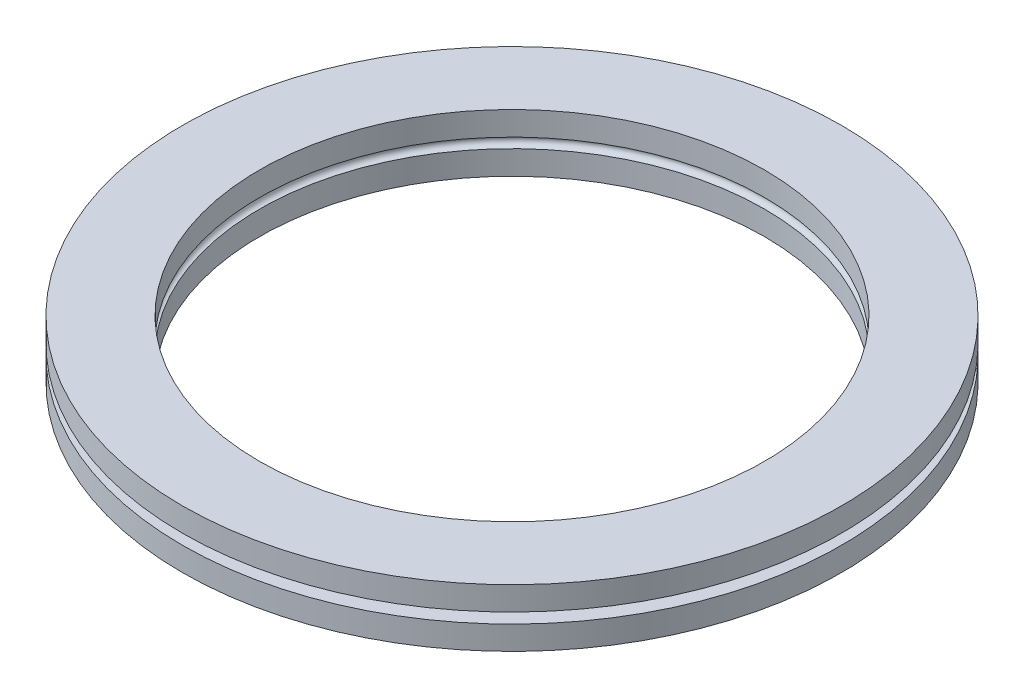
ISO-10303-21;
HEADER;
FILE_DESCRIPTION(('STEP AP214'),'2;1');
FILE_NAME('part.step','',(''),(''),'','','');
FILE_SCHEMA(('AUTOMOTIVE_DESIGN { 1 0 10303 214 1 1 1 1 }'));
ENDSEC;
DATA;
#1=APPLICATION_CONTEXT('core data for automotive mechanical design processes');
#2=APPLICATION_PROTOCOL_DEFINITION('international standard','automotive_design',2000,#1);
#3=PRODUCT_CONTEXT('',#1,'mechanical');
#4=PRODUCT('Part','Part','',(#3));
#5=PRODUCT_RELATED_PRODUCT_CATEGORY('part','',(#4));
#6=PRODUCT_DEFINITION_FORMATION('','',#4);
#7=PRODUCT_DEFINITION_CONTEXT('part definition',#1,'design');
#8=PRODUCT_DEFINITION('design','',#6,#7);
#9=PRODUCT_DEFINITION_SHAPE('','',#8);
#10=(LENGTH_UNIT() NAMED_UNIT(*) SI_UNIT(.MILLI.,.METRE.));
#11=(NAMED_UNIT(*) PLANE_ANGLE_UNIT() SI_UNIT($,.RADIAN.));
#12=(NAMED_UNIT(*) SI_UNIT($,.STERADIAN.) SOLID_ANGLE_UNIT());
#13=UNCERTAINTY_MEASURE_WITH_UNIT(LENGTH_MEASURE(1.E-05),#10,'distance_accuracy_value','');
#14=(GEOMETRIC_REPRESENTATION_CONTEXT(3) GLOBAL_UNCERTAINTY_ASSIGNED_CONTEXT((#13)) GLOBAL_UNIT_ASSIGNED_CONTEXT((#10,
#11,#12)) REPRESENTATION_CONTEXT('',''));
#15=CARTESIAN_POINT('',(0.,0.,0.));
#16=DIRECTION('',(0.,0.,1.));
#17=DIRECTION('',(1.,0.,0.));
#18=AXIS2_PLACEMENT_3D('',#15,#16,#17);
#19=CARTESIAN_POINT('',(0.,-8.7014749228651,0.));
#20=DIRECTION('',(0.,-1.,0.));
#21=DIRECTION('',(0.,0.,-1.));
#22=AXIS2_PLACEMENT_3D('',#19,#20,#21);
#23=CYLINDRICAL_SURFACE('',#22,108.585);
#24=CARTESIAN_POINT('',(0.,4.63550000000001,0.));
#25=DIRECTION('',(0.,-1.,0.));
#26=DIRECTION('',(0.,0.,-1.));
#27=AXIS2_PLACEMENT_3D('',#24,#25,#26);
#28=CIRCLE('',#27,108.585);
#29=CARTESIAN_POINT('',(0.,4.63550000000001,-108.585));
#30=VERTEX_POINT('',#29);
#31=EDGE_CURVE('E51',#30,#30,#28,.T.);
#32=ORIENTED_EDGE('',*,*,#31,.T.);
#33=EDGE_LOOP('',(#32));
#34=FACE_BOUND('',#33,.T.);
#35=CARTESIAN_POINT('',(0.,-3.17500000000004,0.));
#36=DIRECTION('',(0.,-1.,0.));
#37=DIRECTION('',(0.,0.,-1.));
#38=AXIS2_PLACEMENT_3D('',#35,#36,#37);
#39=CIRCLE('',#38,108.585);
#40=CARTESIAN_POINT('',(0.,-3.17500000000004,-108.585));
#41=VERTEX_POINT('',#40);
#42=EDGE_CURVE('E113',#41,#41,#39,.T.);
#43=ORIENTED_EDGE('',*,*,#42,.F.);
#44=EDGE_LOOP('',(#43));
#45=FACE_BOUND('',#44,.T.);
#46=ADVANCED_FACE('F28',(#34,#45),#23,.T.);
#47=CARTESIAN_POINT('',(108.585,4.63550000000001,0.));
#48=DIRECTION('',(0.,1.,0.));
#49=DIRECTION('',(0.,0.,1.));
#50=AXIS2_PLACEMENT_3D('',#47,#48,#49);
#51=PLANE('',#50);
#52=CARTESIAN_POINT('',(0.,4.63550000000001,0.));
#53=DIRECTION('',(0.,-1.,0.));
#54=DIRECTION('',(0.,0.,-1.));
#55=AXIS2_PLACEMENT_3D('',#52,#53,#54);
#56=CIRCLE('',#55,95.885);
#57=CARTESIAN_POINT('',(0.,4.63550000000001,-95.885));
#58=VERTEX_POINT('',#57);
#59=EDGE_CURVE('E86',#58,#58,#56,.T.);
#60=ORIENTED_EDGE('',*,*,#59,.T.);
#61=EDGE_LOOP('',(#60));
#62=FACE_BOUND('',#61,.T.);
#63=ORIENTED_EDGE('',*,*,#31,.F.);
#64=EDGE_LOOP('',(#63));
#65=FACE_BOUND('',#64,.T.);
#66=ADVANCED_FACE('F94',(#62,#65),#51,.T.);
#67=CARTESIAN_POINT('',(0.,-8.7014749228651,0.));
#68=DIRECTION('',(0.,-1.,0.));
#69=DIRECTION('',(0.,0.,-1.));
#70=AXIS2_PLACEMENT_3D('',#67,#68,#69);
#71=CYLINDRICAL_SURFACE('',#70,95.885);
#72=CARTESIAN_POINT('',(85.4075,6.34999999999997,-43.5831638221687));
#73=CARTESIAN_POINT('',(85.4074968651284,6.30424529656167,-43.5831700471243));
#74=CARTESIAN_POINT('',(85.4055753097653,6.2584340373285,-43.586936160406));
#75=CARTESIAN_POINT('',(85.3980933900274,6.16824643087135,-43.601593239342));
#76=CARTESIAN_POINT('',(85.392525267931,6.12387335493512,-43.6124993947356));
#77=CARTESIAN_POINT('',(85.3765644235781,6.02731621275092,-43.6437377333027));
#78=CARTESIAN_POINT('',(85.3653359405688,5.97580453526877,-43.66570120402));
#79=CARTESIAN_POINT('',(85.3392462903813,5.87743285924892,-43.716668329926));
#80=CARTESIAN_POINT('',(85.3243785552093,5.83058148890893,-43.7456847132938));
#81=CARTESIAN_POINT('',(85.2822356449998,5.71460964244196,-43.8278073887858));
#82=CARTESIAN_POINT('',(85.2528847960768,5.64909628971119,-43.8848893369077));
#83=CARTESIAN_POINT('',(85.1900202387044,5.52812318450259,-44.0067998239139));
#84=CARTESIAN_POINT('',(85.1564954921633,5.47269108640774,-44.0716488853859));
#85=CARTESIAN_POINT('',(85.0876820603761,5.37154043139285,-44.2043552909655));
#86=CARTESIAN_POINT('',(85.0524660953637,5.32559879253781,-44.272082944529));
#87=CARTESIAN_POINT('',(84.980192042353,5.24026745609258,-44.4106553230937));
#88=CARTESIAN_POINT('',(84.9431322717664,5.2008838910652,-44.4815028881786));
#89=CARTESIAN_POINT('',(84.867596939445,5.12769365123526,-44.6254505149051));
#90=CARTESIAN_POINT('',(84.8291190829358,5.09389654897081,-44.6985541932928));
#91=CARTESIAN_POINT('',(84.7510970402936,5.03125947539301,-44.8463127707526));
#92=CARTESIAN_POINT('',(84.7115524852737,5.0024212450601,-44.9209682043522));
#93=CARTESIAN_POINT('',(84.5950171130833,4.92480574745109,-45.1402577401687));
#94=CARTESIAN_POINT('',(84.5168837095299,4.88194062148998,-45.2863940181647));
#95=CARTESIAN_POINT('',(84.3583979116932,4.81017095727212,-45.5809387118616));
#96=CARTESIAN_POINT('',(84.2780436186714,4.78127878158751,-45.7293490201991));
#97=CARTESIAN_POINT('',(84.1155692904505,4.7363125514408,-46.0275255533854));
#98=CARTESIAN_POINT('',(84.0334460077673,4.72026458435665,-46.1772939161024));
#99=CARTESIAN_POINT('',(83.8680894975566,4.70067393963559,-46.4769411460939));
#100=CARTESIAN_POINT('',(83.7848568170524,4.69712531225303,-46.6268199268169));
#101=CARTESIAN_POINT('',(83.6291953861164,4.70233732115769,-46.9053594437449));
#102=CARTESIAN_POINT('',(83.556856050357,4.70947127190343,-47.0341018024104));
#103=CARTESIAN_POINT('',(83.4119523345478,4.73368063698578,-47.2906029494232));
#104=CARTESIAN_POINT('',(83.3393878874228,4.75075936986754,-47.4183613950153));
#105=CARTESIAN_POINT('',(83.1948381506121,4.79563861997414,-47.6715142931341));
#106=CARTESIAN_POINT('',(83.1228517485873,4.82338768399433,-47.7969171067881));
#107=CARTESIAN_POINT('',(82.9797782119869,4.89096994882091,-48.0448755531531));
#108=CARTESIAN_POINT('',(82.9086902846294,4.93079158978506,-48.1674337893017));
#109=CARTESIAN_POINT('',(82.7863121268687,5.01266010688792,-48.3773761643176));
#110=CARTESIAN_POINT('',(82.7346044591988,5.05153854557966,-48.4657462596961));
#111=CARTESIAN_POINT('',(82.6328115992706,5.13854640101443,-48.6390971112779));
#112=CARTESIAN_POINT('',(82.582728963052,5.18668963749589,-48.724072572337));
#113=CARTESIAN_POINT('',(82.4849486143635,5.29439104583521,-48.8894240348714));
#114=CARTESIAN_POINT('',(82.4372764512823,5.35404814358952,-48.9697517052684));
#115=CARTESIAN_POINT('',(82.3468597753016,5.48678360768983,-49.1216411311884));
#116=CARTESIAN_POINT('',(82.3040995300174,5.55981706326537,-49.1932309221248));
#117=CARTESIAN_POINT('',(82.2444057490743,5.68532312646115,-49.2929273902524));
#118=CARTESIAN_POINT('',(82.2244955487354,5.73230744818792,-49.3261270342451));
#119=CARTESIAN_POINT('',(82.1882096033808,5.83130535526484,-49.386563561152));
#120=CARTESIAN_POINT('',(82.171833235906,5.88331805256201,-49.4138014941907));
#121=CARTESIAN_POINT('',(82.1436146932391,5.99274925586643,-49.460697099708));
#122=CARTESIAN_POINT('',(82.1318335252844,6.05022866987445,-49.4802528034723));
#123=CARTESIAN_POINT('',(82.1144163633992,6.16857717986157,-49.5091521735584));
#124=CARTESIAN_POINT('',(82.108767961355,6.22943916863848,-49.5185164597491));
#125=CARTESIAN_POINT('',(82.1046662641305,6.34351649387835,-49.5253168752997));
#126=CARTESIAN_POINT('',(82.1053194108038,6.39661454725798,-49.5242343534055));
#127=CARTESIAN_POINT('',(82.1116402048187,6.50168266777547,-49.5137536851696));
#128=CARTESIAN_POINT('',(82.1173098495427,6.55365227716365,-49.5043522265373));
#129=CARTESIAN_POINT('',(82.1324985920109,6.65112326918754,-49.4791480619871));
#130=CARTESIAN_POINT('',(82.141697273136,6.69681749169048,-49.4638780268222));
#131=CARTESIAN_POINT('',(82.163255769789,6.78525585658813,-49.4280594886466));
#132=CARTESIAN_POINT('',(82.1756161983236,6.82799942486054,-49.4075099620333));
#133=CARTESIAN_POINT('',(82.2119543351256,6.93770802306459,-49.3470334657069));
#134=CARTESIAN_POINT('',(82.238184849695,7.00183350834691,-49.3033188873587));
#135=CARTESIAN_POINT('',(82.2953309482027,7.12149991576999,-49.2078737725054));
#136=CARTESIAN_POINT('',(82.3262615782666,7.17701206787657,-49.1561174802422));
#137=CARTESIAN_POINT('',(82.3864983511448,7.27282791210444,-49.0550819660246));
#138=CARTESIAN_POINT('',(82.4153938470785,7.31417017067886,-49.0065247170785));
#139=CARTESIAN_POINT('',(82.4748116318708,7.39185896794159,-48.9064623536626));
#140=CARTESIAN_POINT('',(82.5053351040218,7.42820180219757,-48.8549550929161));
#141=CARTESIAN_POINT('',(82.567574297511,7.49646938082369,-48.7496937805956));
#142=CARTESIAN_POINT('',(82.5992914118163,7.52838874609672,-48.6959370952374));
#143=CARTESIAN_POINT('',(82.6635771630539,7.58824373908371,-48.5867292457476));
#144=CARTESIAN_POINT('',(82.6961461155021,7.61617786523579,-48.5312774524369));
#145=CARTESIAN_POINT('',(82.7906781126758,7.69134636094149,-48.3699460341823));
#146=CARTESIAN_POINT('',(82.8534176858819,7.73407312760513,-48.2624103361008));
#147=CARTESIAN_POINT('',(82.9800616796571,7.80888561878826,-48.0443392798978));
#148=CARTESIAN_POINT('',(83.0439670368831,7.84096234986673,-47.9338014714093));
#149=CARTESIAN_POINT('',(83.1724582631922,7.89582840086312,-47.7105023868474));
#150=CARTESIAN_POINT('',(83.2370453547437,7.91859630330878,-47.5977366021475));
#151=CARTESIAN_POINT('',(83.3663547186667,7.95564879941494,-47.3708897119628));
#152=CARTESIAN_POINT('',(83.4310770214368,7.96993121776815,-47.256808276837));
#153=CARTESIAN_POINT('',(83.5897885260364,7.99532593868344,-46.975706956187));
#154=CARTESIAN_POINT('',(83.6836893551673,8.0020359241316,-46.8082275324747));
#155=CARTESIAN_POINT('',(83.8704828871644,7.99970737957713,-46.4727044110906));
#156=CARTESIAN_POINT('',(83.9633747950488,7.99065722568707,-46.3046603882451));
#157=CARTESIAN_POINT('',(84.1474399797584,7.95677583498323,-45.9693167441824));
#158=CARTESIAN_POINT('',(84.2386144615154,7.9319561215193,-45.8020166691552));
#159=CARTESIAN_POINT('',(84.373522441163,7.8821128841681,-45.5527263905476));
#160=CARTESIAN_POINT('',(84.4181681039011,7.86340460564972,-45.4699338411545));
#161=CARTESIAN_POINT('',(84.5067406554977,7.82151041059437,-45.3051073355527));
#162=CARTESIAN_POINT('',(84.5506676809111,7.79832535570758,-45.223073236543));
#163=CARTESIAN_POINT('',(84.6359509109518,7.7481125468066,-45.0632546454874));
#164=CARTESIAN_POINT('',(84.6773403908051,7.72127105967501,-44.9854296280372));
#165=CARTESIAN_POINT('',(84.7591254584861,7.66265947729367,-44.8311442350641));
#166=CARTESIAN_POINT('',(84.7995213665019,7.63089099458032,-44.7546834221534));
#167=CARTESIAN_POINT('',(84.8789062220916,7.56192415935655,-44.6039429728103));
#168=CARTESIAN_POINT('',(84.9179002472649,7.52474854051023,-44.5296556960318));
#169=CARTESIAN_POINT('',(84.9942368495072,7.44402760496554,-44.3837773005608));
#170=CARTESIAN_POINT('',(85.0315807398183,7.40048747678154,-44.3121840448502));
#171=CARTESIAN_POINT('',(85.0972917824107,7.31459011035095,-44.1858376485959));
#172=CARTESIAN_POINT('',(85.1260400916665,7.27350864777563,-44.1304222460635));
#173=CARTESIAN_POINT('',(85.1815297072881,7.18534997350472,-44.0232195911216));
#174=CARTESIAN_POINT('',(85.2082674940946,7.13826261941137,-43.9714387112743));
#175=CARTESIAN_POINT('',(85.2590692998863,7.03655896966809,-43.8728552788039));
#176=CARTESIAN_POINT('',(85.2830999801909,6.98186418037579,-43.8261150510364));
#177=CARTESIAN_POINT('',(85.3265651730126,6.86437712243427,-43.7414306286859));
#178=CARTESIAN_POINT('',(85.3460148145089,6.80161259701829,-43.7034574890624));
#179=CARTESIAN_POINT('',(85.3719172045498,6.69355939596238,-43.6528287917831));
#180=CARTESIAN_POINT('',(85.3804980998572,6.65072903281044,-43.6360401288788));
#181=CARTESIAN_POINT('',(85.3943567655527,6.56260022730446,-43.6089129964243));
#182=CARTESIAN_POINT('',(85.3996437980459,6.51730909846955,-43.5985564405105));
#183=CARTESIAN_POINT('',(85.4045115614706,6.45132525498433,-43.5890197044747));
#184=CARTESIAN_POINT('',(85.4056290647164,6.43114484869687,-43.5868300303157));
#185=CARTESIAN_POINT('',(85.4071240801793,6.39064670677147,-43.5839005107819));
#186=CARTESIAN_POINT('',(85.4075013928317,6.37032893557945,-43.5831610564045));
#187=CARTESIAN_POINT('',(85.4075,6.34999999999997,-43.5831638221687));
#188=B_SPLINE_CURVE_WITH_KNOTS('',3,(#72,#73,#74,#75,#76,#77,#78,#79,#80,#81,#82,#83,#84,#85,
#86,#87,#88,#89,#90,#91,#92,#93,#94,#95,#96,#97,#98,#99,#100,#101,#102,#103,#104,#105,#106,#107,
#108,#109,#110,#111,#112,#113,#114,#115,#116,#117,#118,#119,#120,#121,#122,#123,#124,#125,#126,
#127,#128,#129,#130,#131,#132,#133,#134,#135,#136,#137,#138,#139,#140,#141,#142,#143,#144,#145,
#146,#147,#148,#149,#150,#151,#152,#153,#154,#155,#156,#157,#158,#159,#160,#161,#162,#163,#164,
#165,#166,#167,#168,#169,#170,#171,#172,#173,#174,#175,#176,#177,#178,#179,#180,#181,#182,#183,
#184,#185,#186,#187),.UNSPECIFIED.,.T.,.F.,(4,2,2,2,2,2,2,2,2,2,2,2,2,2,2,2,2,2,2,2,2,2,2,2,2,2,
2,2,2,2,2,2,2,2,2,2,2,2,2,2,2,2,2,2,2,2,2,2,2,2,2,2,2,2,2,2,2,4),(0.,0.137178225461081,
0.274649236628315,0.445022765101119,0.615706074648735,0.889310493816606,1.16365448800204,
1.43054105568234,1.69767580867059,1.965263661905,2.23294526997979,2.74565556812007,
3.2588186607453,3.77302139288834,4.28697932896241,4.73021122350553,5.17359110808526,
5.61485926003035,6.05570621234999,6.38391045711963,6.71260811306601,7.04426688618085,
7.37483188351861,7.55699897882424,7.73913396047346,7.92361080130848,8.10771369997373,
8.2661421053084,8.42463361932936,8.57124447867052,8.71788378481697,8.96223806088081,
9.20739172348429,9.4171359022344,9.62703466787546,9.83718647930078,10.0474172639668,
10.4416585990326,10.8362320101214,11.2317082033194,11.627285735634,12.2029268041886,
12.7789926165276,13.3546379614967,13.6422671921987,13.929841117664,14.2061418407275,
14.4823523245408,14.7574333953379,15.0322914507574,15.2562189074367,15.4805296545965,
15.7073553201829,15.9334210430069,16.0733136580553,16.2128111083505,16.2737433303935,
16.3346919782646),.UNSPECIFIED.);
#189=CARTESIAN_POINT('',(85.4075,6.34999999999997,-43.5831638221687));
#190=VERTEX_POINT('',#189);
#191=EDGE_CURVE('E54',#190,#190,#188,.T.);
#192=ORIENTED_EDGE('',*,*,#191,.F.);
#193=EDGE_LOOP('',(#192));
#194=FACE_BOUND('',#193,.T.);
#195=CARTESIAN_POINT('',(0.,8.06450000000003,0.));
#196=DIRECTION('',(0.,-1.,0.));
#197=DIRECTION('',(0.,0.,-1.));
#198=AXIS2_PLACEMENT_3D('',#195,#196,#197);
#199=CIRCLE('',#198,95.885);
#200=CARTESIAN_POINT('',(0.,8.06450000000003,-95.885));
#201=VERTEX_POINT('',#200);
#202=EDGE_CURVE('E83',#201,#201,#199,.T.);
#203=ORIENTED_EDGE('',*,*,#202,.T.);
#204=EDGE_LOOP('',(#203));
#205=FACE_BOUND('',#204,.T.);
#206=ORIENTED_EDGE('',*,*,#59,.F.);
#207=EDGE_LOOP('',(#206));
#208=FACE_BOUND('',#207,.T.);
#209=ADVANCED_FACE('F96',(#194,#205,#208),#71,.T.);
#210=CARTESIAN_POINT('',(95.885,8.06450000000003,0.));
#211=DIRECTION('',(0.,-1.,0.));
#212=DIRECTION('',(0.,0.,-1.));
#213=AXIS2_PLACEMENT_3D('',#210,#211,#212);
#214=PLANE('',#213);
#215=CARTESIAN_POINT('',(0.,8.06450000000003,0.));
#216=DIRECTION('',(0.,-1.,0.));
#217=DIRECTION('',(0.,0.,-1.));
#218=AXIS2_PLACEMENT_3D('',#215,#216,#217);
#219=CIRCLE('',#218,108.585);
#220=CARTESIAN_POINT('',(0.,8.06450000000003,-108.585));
#221=VERTEX_POINT('',#220);
#222=EDGE_CURVE('E80',#221,#221,#219,.T.);
#223=ORIENTED_EDGE('',*,*,#222,.T.);
#224=EDGE_LOOP('',(#223));
#225=FACE_BOUND('',#224,.T.);
#226=ORIENTED_EDGE('',*,*,#202,.F.);
#227=EDGE_LOOP('',(#226));
#228=FACE_BOUND('',#227,.T.);
#229=ADVANCED_FACE('F102',(#225,#228),#214,.T.);
#230=CARTESIAN_POINT('',(0.,-8.7014749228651,0.));
#231=DIRECTION('',(0.,-1.,0.));
#232=DIRECTION('',(0.,0.,-1.));
#233=AXIS2_PLACEMENT_3D('',#230,#231,#232);
#234=CYLINDRICAL_SURFACE('',#233,108.585);
#235=CARTESIAN_POINT('',(0.,15.875,0.));
#236=DIRECTION('',(0.,-1.,0.));
#237=DIRECTION('',(0.,0.,-1.));
#238=AXIS2_PLACEMENT_3D('',#235,#236,#237);
#239=CIRCLE('',#238,108.585);
#240=CARTESIAN_POINT('',(0.,15.875,-108.585));
#241=VERTEX_POINT('',#240);
#242=EDGE_CURVE('E72',#241,#241,#239,.T.);
#243=ORIENTED_EDGE('',*,*,#242,.T.);
#244=EDGE_LOOP('',(#243));
#245=FACE_BOUND('',#244,.T.);
#246=ORIENTED_EDGE('',*,*,#222,.F.);
#247=EDGE_LOOP('',(#246));
#248=FACE_BOUND('',#247,.T.);
#249=ADVANCED_FACE('F132',(#245,#248),#234,.T.);
#250=CARTESIAN_POINT('',(83.185,15.875,0.));
#251=DIRECTION('',(0.,1.,0.));
#252=DIRECTION('',(0.,0.,1.));
#253=AXIS2_PLACEMENT_3D('',#250,#251,#252);
#254=PLANE('',#253);
#255=CARTESIAN_POINT('',(0.,15.875,0.));
#256=DIRECTION('',(0.,-1.,0.));
#257=DIRECTION('',(0.,0.,-1.));
#258=AXIS2_PLACEMENT_3D('',#255,#256,#257);
#259=CIRCLE('',#258,83.185);
#260=CARTESIAN_POINT('',(0.,15.875,-83.185));
#261=VERTEX_POINT('',#260);
#262=EDGE_CURVE('E69',#261,#261,#259,.T.);
#263=ORIENTED_EDGE('',*,*,#262,.T.);
#264=EDGE_LOOP('',(#263));
#265=FACE_BOUND('',#264,.T.);
#266=ORIENTED_EDGE('',*,*,#242,.F.);
#267=EDGE_LOOP('',(#266));
#268=FACE_BOUND('',#267,.T.);
#269=ADVANCED_FACE('F130',(#265,#268),#254,.T.);
#270=CARTESIAN_POINT('',(0.,-8.7014749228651,0.));
#271=DIRECTION('',(0.,-1.,0.));
#272=DIRECTION('',(0.,0.,-1.));
#273=AXIS2_PLACEMENT_3D('',#270,#271,#272);
#274=CYLINDRICAL_SURFACE('',#273,83.185);
#275=CARTESIAN_POINT('',(0.,8.00100000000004,0.));
#276=DIRECTION('',(0.,-1.,0.));
#277=DIRECTION('',(0.,0.,-1.));
#278=AXIS2_PLACEMENT_3D('',#275,#276,#277);
#279=CIRCLE('',#278,83.185);
#280=CARTESIAN_POINT('',(0.,8.00100000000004,-83.185));
#281=VERTEX_POINT('',#280);
#282=EDGE_CURVE('E67',#281,#281,#279,.T.);
#283=ORIENTED_EDGE('',*,*,#282,.T.);
#284=EDGE_LOOP('',(#283));
#285=FACE_BOUND('',#284,.T.);
#286=ORIENTED_EDGE('',*,*,#262,.F.);
#287=EDGE_LOOP('',(#286));
#288=FACE_BOUND('',#287,.T.);
#289=ADVANCED_FACE('F60',(#285,#288),#274,.F.);
#290=CARTESIAN_POINT('',(0.,6.34999999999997,0.));
#291=DIRECTION('',(0.,-1.,0.));
#292=DIRECTION('',(0.,0.,-1.));
#293=AXIS2_PLACEMENT_3D('',#290,#291,#292);
#294=TOROIDAL_SURFACE('',#293,83.185,1.65100000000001);
#295=CARTESIAN_POINT('',(83.4707499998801,7.97608361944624,0.0002));
#296=CARTESIAN_POINT('',(83.4707510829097,7.97605274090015,-0.550187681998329));
#297=CARTESIAN_POINT('',(83.4680294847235,7.97560418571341,-1.10057705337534));
#298=CARTESIAN_POINT('',(83.457144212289,7.97365176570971,-2.20126344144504));
#299=CARTESIAN_POINT('',(83.4489808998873,7.97214797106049,-2.75156046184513));
#300=CARTESIAN_POINT('',(83.4314076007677,7.9686900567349,-3.6400824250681));
#301=CARTESIAN_POINT('',(83.4236891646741,7.9671325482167,-3.97834309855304));
#302=CARTESIAN_POINT('',(83.4061975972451,7.96343401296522,-4.65482119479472));
#303=CARTESIAN_POINT('',(83.3964243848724,7.96129296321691,-4.99303861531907));
#304=CARTESIAN_POINT('',(83.3640150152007,7.95382574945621,-6.00790123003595));
#305=CARTESIAN_POINT('',(83.3382953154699,7.94745653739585,-6.68444385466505));
#306=CARTESIAN_POINT('',(83.2786525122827,7.93063951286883,-8.03713574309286));
#307=CARTESIAN_POINT('',(83.2447291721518,7.92019158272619,-8.71328499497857));
#308=CARTESIAN_POINT('',(83.1687019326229,7.89335177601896,-10.0650656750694));
#309=CARTESIAN_POINT('',(83.126597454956,7.87695947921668,-10.7406970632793));
#310=CARTESIAN_POINT('',(83.0573386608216,7.84586261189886,-11.7535102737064));
#311=CARTESIAN_POINT('',(83.0332358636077,7.8344125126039,-12.0910030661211));
#312=CARTESIAN_POINT('',(82.9830036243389,7.80887000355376,-12.7657366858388));
#313=CARTESIAN_POINT('',(82.9568742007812,7.79477761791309,-13.102977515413));
#314=CARTESIAN_POINT('',(82.9025947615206,7.76337547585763,-13.7771924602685));
#315=CARTESIAN_POINT('',(82.874444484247,7.74606530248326,-14.1141665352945));
#316=CARTESIAN_POINT('',(82.8161390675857,7.70747828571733,-14.787727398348));
#317=CARTESIAN_POINT('',(82.7859838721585,7.68620133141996,-15.1243141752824));
#318=CARTESIAN_POINT('',(82.7236961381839,7.63866304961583,-15.7968874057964));
#319=CARTESIAN_POINT('',(82.6915639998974,7.61240272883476,-16.1328739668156));
#320=CARTESIAN_POINT('',(82.6253502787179,7.5534463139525,-16.8040826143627));
#321=CARTESIAN_POINT('',(82.5912688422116,7.52075070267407,-17.1393047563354));
#322=CARTESIAN_POINT('',(82.5387233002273,7.46510690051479,-17.6413121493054));
#323=CARTESIAN_POINT('',(82.5209679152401,7.4454552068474,-17.8085371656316));
#324=CARTESIAN_POINT('',(82.4849958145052,7.40349177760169,-18.1426145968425));
#325=CARTESIAN_POINT('',(82.4667790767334,7.3811799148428,-18.3094669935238));
#326=CARTESIAN_POINT('',(82.4298982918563,7.33328276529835,-18.642705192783));
#327=CARTESIAN_POINT('',(82.4112341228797,7.30769657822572,-18.8090908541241));
#328=CARTESIAN_POINT('',(82.3734966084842,7.25234395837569,-19.1411026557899));
#329=CARTESIAN_POINT('',(82.35442331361,7.22257803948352,-19.3067288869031));
#330=CARTESIAN_POINT('',(82.3158968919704,7.15741470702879,-19.6370337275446));
#331=CARTESIAN_POINT('',(82.2964434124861,7.12201182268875,-19.8017112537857));
#332=CARTESIAN_POINT('',(82.267091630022,7.06269930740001,-20.0471385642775));
#333=CARTESIAN_POINT('',(82.2572831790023,7.04190360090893,-20.1286496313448));
#334=CARTESIAN_POINT('',(82.2376367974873,6.99764743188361,-20.2909366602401));
#335=CARTESIAN_POINT('',(82.2277988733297,6.97418750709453,-20.3717127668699));
#336=CARTESIAN_POINT('',(82.210119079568,6.92876924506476,-20.5160265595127));
#337=CARTESIAN_POINT('',(82.2022734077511,6.90745666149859,-20.5797661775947));
#338=CARTESIAN_POINT('',(82.1866362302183,6.86177830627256,-20.7062248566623));
#339=CARTESIAN_POINT('',(82.178844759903,6.83741070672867,-20.768943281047));
#340=CARTESIAN_POINT('',(82.1636855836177,6.78526319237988,-20.8904323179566));
#341=CARTESIAN_POINT('',(82.1563124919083,6.75762818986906,-20.9492646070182));
#342=CARTESIAN_POINT('',(82.1418710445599,6.69613516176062,-21.0640292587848));
#343=CARTESIAN_POINT('',(82.1348030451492,6.66227009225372,-21.1199582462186));
#344=CARTESIAN_POINT('',(82.124881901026,6.60302154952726,-21.1981883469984));
#345=CARTESIAN_POINT('',(82.1216699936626,6.58169918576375,-21.2234644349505));
#346=CARTESIAN_POINT('',(82.1157401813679,6.53509245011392,-21.2700556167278));
#347=CARTESIAN_POINT('',(82.1130180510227,6.50984585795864,-21.2914046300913));
#348=CARTESIAN_POINT('',(82.109877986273,6.47068500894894,-21.3160053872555));
#349=CARTESIAN_POINT('',(82.1090481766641,6.45887355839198,-21.3225027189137));
#350=CARTESIAN_POINT('',(82.107613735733,6.43441175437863,-21.3337304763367));
#351=CARTESIAN_POINT('',(82.1070089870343,6.42176184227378,-21.3384618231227));
#352=CARTESIAN_POINT('',(82.1060797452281,6.39566740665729,-21.3457305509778));
#353=CARTESIAN_POINT('',(82.1057583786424,6.38221572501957,-21.3482434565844));
#354=CARTESIAN_POINT('',(82.1054522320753,6.35507810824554,-21.3506373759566));
#355=CARTESIAN_POINT('',(82.1054671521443,6.34139239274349,-21.3505207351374));
#356=CARTESIAN_POINT('',(82.1058097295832,6.31582266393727,-21.3478418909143));
#357=CARTESIAN_POINT('',(82.1061023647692,6.30390777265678,-21.3455535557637));
#358=CARTESIAN_POINT('',(82.1069185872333,6.28058342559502,-21.3391690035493));
#359=CARTESIAN_POINT('',(82.1074423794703,6.26917442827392,-21.3350711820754));
#360=CARTESIAN_POINT('',(82.1090015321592,6.2412044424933,-21.322868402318));
#361=CARTESIAN_POINT('',(82.1101611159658,6.22507963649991,-21.3137890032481));
#362=CARTESIAN_POINT('',(82.112775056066,6.1944136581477,-21.2933053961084));
#363=CARTESIAN_POINT('',(82.1142302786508,6.17987733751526,-21.2818943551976));
#364=CARTESIAN_POINT('',(82.1187883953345,6.13919749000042,-21.2461183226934));
#365=CARTESIAN_POINT('',(82.1221557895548,6.1149654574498,-21.2196475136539));
#366=CARTESIAN_POINT('',(82.1292362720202,6.07013881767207,-21.1638707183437));
#367=CARTESIAN_POINT('',(82.1329504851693,6.04955672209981,-21.1345554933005));
#368=CARTESIAN_POINT('',(82.1436020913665,5.99555977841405,-21.0502976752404));
#369=CARTESIAN_POINT('',(82.1507469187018,5.96500699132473,-20.9935680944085));
#370=CARTESIAN_POINT('',(82.1652765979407,5.90883003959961,-20.8777100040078));
#371=CARTESIAN_POINT('',(82.1726620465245,5.88321942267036,-20.818575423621));
#372=CARTESIAN_POINT('',(82.1875746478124,5.83530843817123,-20.698648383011));
#373=CARTESIAN_POINT('',(82.1951023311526,5.81302562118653,-20.637849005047));
#374=CARTESIAN_POINT('',(82.2101847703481,5.7710332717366,-20.5154830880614));
#375=CARTESIAN_POINT('',(82.2177394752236,5.75132026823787,-20.4539177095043));
#376=CARTESIAN_POINT('',(82.2402305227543,5.69552327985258,-20.2697919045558));
#377=CARTESIAN_POINT('',(82.2551703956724,5.66225291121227,-20.1463823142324));
#378=CARTESIAN_POINT('',(82.2849255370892,5.60072050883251,-19.8982925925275));
#379=CARTESIAN_POINT('',(82.2997407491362,5.57246063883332,-19.7736119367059));
#380=CARTESIAN_POINT('',(82.3292078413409,5.51960544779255,-19.5232480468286));
#381=CARTESIAN_POINT('',(82.3438594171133,5.49501615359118,-19.3975635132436));
#382=CARTESIAN_POINT('',(82.3729414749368,5.44871662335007,-19.1456385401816));
#383=CARTESIAN_POINT('',(82.3873719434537,5.42700656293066,-19.0193980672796));
#384=CARTESIAN_POINT('',(82.4159641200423,5.38595200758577,-18.7667525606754));
#385=CARTESIAN_POINT('',(82.4301262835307,5.36660312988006,-18.6403482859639));
#386=CARTESIAN_POINT('',(82.4581972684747,5.32983066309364,-18.3872282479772));
#387=CARTESIAN_POINT('',(82.4721060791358,5.31240715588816,-18.2605124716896));
#388=CARTESIAN_POINT('',(82.4996470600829,5.27921232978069,-18.006965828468));
#389=CARTESIAN_POINT('',(82.5132794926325,5.26343937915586,-17.8801352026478));
#390=CARTESIAN_POINT('',(82.5402753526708,5.23330540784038,-17.6262808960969));
#391=CARTESIAN_POINT('',(82.5536387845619,5.21894436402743,-17.4992572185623));
#392=CARTESIAN_POINT('',(82.5931998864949,5.1778301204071,-17.1190858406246));
#393=CARTESIAN_POINT('',(82.6189921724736,5.15290016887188,-16.8656980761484));
#394=CARTESIAN_POINT('',(82.6694667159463,5.10689064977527,-16.3584595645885));
#395=CARTESIAN_POINT('',(82.6941489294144,5.08581123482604,-16.1046087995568));
#396=CARTESIAN_POINT('',(82.7423897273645,5.04679469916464,-15.5965270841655));
#397=CARTESIAN_POINT('',(82.7659481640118,5.02885799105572,-15.342296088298));
#398=CARTESIAN_POINT('',(82.8119271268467,4.99560535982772,-14.8335587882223));
#399=CARTESIAN_POINT('',(82.8343476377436,4.98028947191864,-14.5790524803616));
#400=CARTESIAN_POINT('',(82.8999270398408,4.93761798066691,-13.8147681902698));
#401=CARTESIAN_POINT('',(82.9413628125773,4.91357016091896,-13.3046563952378));
#402=CARTESIAN_POINT('',(83.0195955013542,4.87191948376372,-12.2838644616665));
#403=CARTESIAN_POINT('',(83.0563927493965,4.85431616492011,-11.7731843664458));
#404=CARTESIAN_POINT('',(83.1253381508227,4.8239415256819,-10.7512018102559));
#405=CARTESIAN_POINT('',(83.1574847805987,4.81117178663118,-10.2398992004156));
#406=CARTESIAN_POINT('',(83.2170973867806,4.78927843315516,-9.21693644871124));
#407=CARTESIAN_POINT('',(83.2445632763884,4.78015488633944,-8.70527630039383));
#408=CARTESIAN_POINT('',(83.2947915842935,4.7646558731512,-7.68187876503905));
#409=CARTESIAN_POINT('',(83.3175557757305,4.75827936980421,-7.17014148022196));
#410=CARTESIAN_POINT('',(83.3583844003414,4.74757992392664,-6.14645798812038));
#411=CARTESIAN_POINT('',(83.3764488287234,4.74325698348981,-5.63451178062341));
#412=CARTESIAN_POINT('',(83.4052610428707,4.73673891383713,-4.69552447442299));
#413=CARTESIAN_POINT('',(83.4167257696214,4.73430960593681,-4.26850676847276));
#414=CARTESIAN_POINT('',(83.436380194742,4.73030110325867,-3.4143658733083));
#415=CARTESIAN_POINT('',(83.4445696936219,4.72872196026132,-2.98724267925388));
#416=CARTESIAN_POINT('',(83.4576635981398,4.72625600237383,-2.133399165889));
#417=CARTESIAN_POINT('',(83.4625714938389,4.72536845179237,-1.70667890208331));
#418=CARTESIAN_POINT('',(83.4691149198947,4.72420411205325,-0.853239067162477));
#419=CARTESIAN_POINT('',(83.4707506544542,4.72392728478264,-0.426519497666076));
#420=CARTESIAN_POINT('',(83.47074999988,4.72391638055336,0.000200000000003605));
#421=B_SPLINE_CURVE_WITH_KNOTS('',3,(#295,#296,#297,#298,#299,#300,#301,#302,#303,#304,#305,
#306,#307,#308,#309,#310,#311,#312,#313,#314,#315,#316,#317,#318,#319,#320,#321,#322,#323,#324,
#325,#326,#327,#328,#329,#330,#331,#332,#333,#334,#335,#336,#337,#338,#339,#340,#341,#342,#343,
#344,#345,#346,#347,#348,#349,#350,#351,#352,#353,#354,#355,#356,#357,#358,#359,#360,#361,#362,
#363,#364,#365,#366,#367,#368,#369,#370,#371,#372,#373,#374,#375,#376,#377,#378,#379,#380,#381,
#382,#383,#384,#385,#386,#387,#388,#389,#390,#391,#392,#393,#394,#395,#396,#397,#398,#399,#400,
#401,#402,#403,#404,#405,#406,#407,#408,#409,#410,#411,#412,#413,#414,#415,#416,#417,#418,#419,
#420),.UNSPECIFIED.,.F.,.F.,(4,2,2,2,2,2,2,2,2,2,2,2,2,2,2,2,2,2,2,2,2,2,2,2,2,2,2,2,2,2,2,2,2,
2,2,2,2,2,2,2,2,2,2,2,2,2,2,2,2,2,2,2,2,2,2,2,2,2,2,2,2,2,4),(0.,1.65115936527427,
3.30220894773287,4.31725950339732,5.3323500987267,7.36347017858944,9.39464886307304,
11.4259711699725,12.4415963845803,13.4572123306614,14.4729599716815,15.4887360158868,
16.5043070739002,17.5198019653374,18.0277129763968,18.5356482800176,19.0437235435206,
19.5517363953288,20.060245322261,20.3142908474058,20.5682851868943,20.7712340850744,
20.974304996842,21.1704424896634,21.3668031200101,21.466266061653,21.564824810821,
21.6052309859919,21.6456160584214,21.6864413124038,21.7272301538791,21.7634753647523,
21.799752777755,21.8550565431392,21.9105247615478,22.0180552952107,22.1259475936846,
22.3199155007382,22.5144077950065,22.7098921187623,22.9051096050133,23.2909790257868,
23.6770146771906,24.0636773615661,24.4503636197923,24.8363208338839,25.2222944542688,
25.6078828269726,25.9934648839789,26.7611627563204,27.528891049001,28.2967200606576,
29.0645593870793,30.6015417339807,32.1384140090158,33.675788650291,35.2131917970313,
36.7500140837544,38.2868379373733,39.5683603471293,40.8499608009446,42.1301960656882,
43.4103514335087),.UNSPECIFIED.);
#422=CARTESIAN_POINT('',(83.4707499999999,7.97608361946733,0.));
#423=VERTEX_POINT('',#422);
#424=CARTESIAN_POINT('',(83.47075,4.7239163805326,0.));
#425=VERTEX_POINT('',#424);
#426=EDGE_CURVE('E11',#423,#425,#421,.T.);
#427=ORIENTED_EDGE('',*,*,#426,.F.);
#428=CARTESIAN_POINT('',(83.185,6.34999999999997,0.));
#429=DIRECTION('',(0.,0.,1.));
#430=DIRECTION('',(1.,0.,0.));
#431=AXIS2_PLACEMENT_3D('',#428,#429,#430);
#432=CIRCLE('',#431,1.65100000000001);
#433=EDGE_CURVE('E40',#425,#423,#432,.T.);
#434=ORIENTED_EDGE('',*,*,#433,.F.);
#435=EDGE_LOOP('',(#427,#434));
#436=FACE_BOUND('',#435,.T.);
#437=CARTESIAN_POINT('',(0.,4.69900000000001,0.));
#438=DIRECTION('',(0.,-1.,0.));
#439=DIRECTION('',(0.,0.,-1.));
#440=AXIS2_PLACEMENT_3D('',#437,#438,#439);
#441=CIRCLE('',#440,83.185);
#442=CARTESIAN_POINT('',(0.,4.69900000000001,-83.185));
#443=VERTEX_POINT('',#442);
#444=EDGE_CURVE('E64',#443,#443,#441,.T.);
#445=ORIENTED_EDGE('',*,*,#444,.T.);
#446=EDGE_LOOP('',(#445));
#447=FACE_BOUND('',#446,.T.);
#448=ORIENTED_EDGE('',*,*,#282,.F.);
#449=EDGE_LOOP('',(#448));
#450=FACE_BOUND('',#449,.T.);
#451=ADVANCED_FACE('F56',(#436,#447,#450),#294,.F.);
#452=CARTESIAN_POINT('',(0.,-8.7014749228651,0.));
#453=DIRECTION('',(0.,-1.,0.));
#454=DIRECTION('',(0.,0.,-1.));
#455=AXIS2_PLACEMENT_3D('',#452,#453,#454);
#456=CYLINDRICAL_SURFACE('',#455,83.185);
#457=CARTESIAN_POINT('',(0.,-3.17500000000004,0.));
#458=DIRECTION('',(0.,-1.,0.));
#459=DIRECTION('',(0.,0.,-1.));
#460=AXIS2_PLACEMENT_3D('',#457,#458,#459);
#461=CIRCLE('',#460,83.185);
#462=CARTESIAN_POINT('',(0.,-3.17500000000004,-83.185));
#463=VERTEX_POINT('',#462);
#464=EDGE_CURVE('E74',#463,#463,#461,.T.);
#465=ORIENTED_EDGE('',*,*,#464,.T.);
#466=EDGE_LOOP('',(#465));
#467=FACE_BOUND('',#466,.T.);
#468=ORIENTED_EDGE('',*,*,#444,.F.);
#469=EDGE_LOOP('',(#468));
#470=FACE_BOUND('',#469,.T.);
#471=ADVANCED_FACE('F59',(#467,#470),#456,.F.);
#472=CARTESIAN_POINT('',(108.585,-3.17500000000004,0.));
#473=DIRECTION('',(0.,-1.,0.));
#474=DIRECTION('',(0.,0.,-1.));
#475=AXIS2_PLACEMENT_3D('',#472,#473,#474);
#476=PLANE('',#475);
#477=ORIENTED_EDGE('',*,*,#42,.T.);
#478=EDGE_LOOP('',(#477));
#479=FACE_BOUND('',#478,.T.);
#480=ORIENTED_EDGE('',*,*,#464,.F.);
#481=EDGE_LOOP('',(#480));
#482=FACE_BOUND('',#481,.T.);
#483=ADVANCED_FACE('F118',(#479,#482),#476,.T.);
#484=CARTESIAN_POINT('',(83.7565,6.34999999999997,-108.585));
#485=DIRECTION('',(0.,0.,1.));
#486=DIRECTION('',(1.,0.,0.));
#487=AXIS2_PLACEMENT_3D('',#484,#485,#486);
#488=CYLINDRICAL_SURFACE('',#487,1.65100000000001);
#489=ORIENTED_EDGE('',*,*,#191,.T.);
#490=EDGE_LOOP('',(#489));
#491=FACE_BOUND('',#490,.T.);
#492=ORIENTED_EDGE('',*,*,#426,.T.);
#493=CARTESIAN_POINT('',(83.7565,6.34999999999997,0.));
#494=DIRECTION('',(0.,0.,1.));
#495=DIRECTION('',(1.,0.,0.));
#496=AXIS2_PLACEMENT_3D('',#493,#494,#495);
#497=CIRCLE('',#496,1.65100000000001);
#498=EDGE_CURVE('E46',#425,#423,#497,.T.);
#499=ORIENTED_EDGE('',*,*,#498,.T.);
#500=EDGE_LOOP('',(#492,#499));
#501=FACE_BOUND('',#500,.T.);
#502=ADVANCED_FACE('F53',(#491,#501),#488,.F.);
#503=CARTESIAN_POINT('',(83.7565,6.34999999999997,0.));
#504=DIRECTION('',(0.,0.,1.));
#505=DIRECTION('',(1.,0.,0.));
#506=AXIS2_PLACEMENT_3D('',#503,#504,#505);
#507=PLANE('',#506);
#508=ORIENTED_EDGE('',*,*,#433,.T.);
#509=ORIENTED_EDGE('',*,*,#498,.F.);
#510=EDGE_LOOP('',(#508,#509));
#511=FACE_BOUND('',#510,.T.);
#512=ADVANCED_FACE('F48',(#511),#507,.F.);
#513=CLOSED_SHELL('',(#46,#66,#209,#229,#249,#269,#289,#451,#471,#483,#502,#512));
#514=MANIFOLD_SOLID_BREP('B2',#513);
#515=ADVANCED_BREP_SHAPE_REPRESENTATION('',(#18,#514),#14);
#516=SHAPE_DEFINITION_REPRESENTATION(#9,#515);
ENDSEC;
END-ISO-10303-21;
